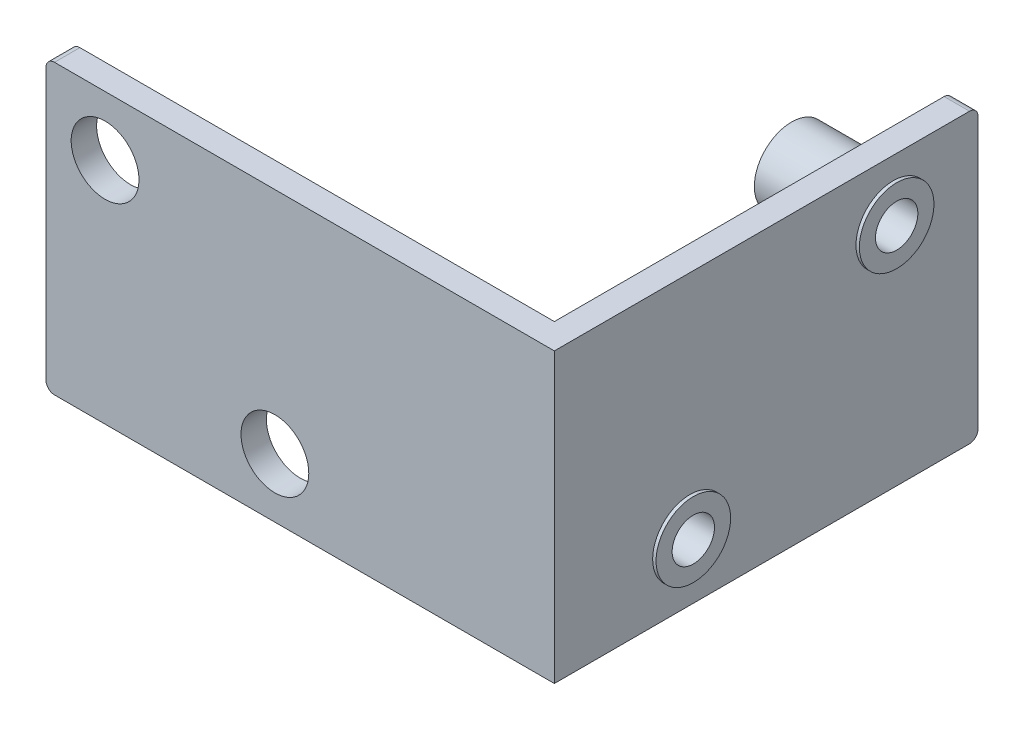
from build123d import *

# Parameters (mm, degrees)
ESQUISSE1_W             = 30
ESQUISSE1_H             = 17
EXTRUSION1_DEPTH        = 1.5
ESQUISSE2_R             = 2
ENL_V_MAT_EXTRU_1_DEPTH = 2
ESQUISSE3_W             = 1.5
ESQUISSE3_H             = 17
EXTRUSION2_DEPTH        = 23.5
ESQUISSE4_R             = 1.25
ENL_V_MAT_EXTRU_2_DEPTH = 2
EXTRUSION3_DEPTH        = 0.2
EXTRUSION3_DEPTH_BACK   = 6
ESQUISSE5_R             = 2.2
ESQUISSE5_R_2           = 1.25
CONG_1_R                = 0.5


with BuildPart() as part:
    # Esquisse1 → Extrusion1 (new body)
    with BuildSketch(Plane.XY):
        with Locations((6.051065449, -10.06674277)):
            Rectangle(ESQUISSE1_W, ESQUISSE1_H)
    extrude(amount=EXTRUSION1_DEPTH)

    # Esquisse2 → Enl_v. mat.-Extru.1 (cut)
    with BuildSketch(Plane.XY.offset(1.5)):
        with Locations((-5.463077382, -5.076163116)):
            Circle(ESQUISSE2_R)
        with Locations((4.558431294, -15.07006433)):
            Circle(ESQUISSE2_R)
    extrude(amount=-ENL_V_MAT_EXTRU_1_DEPTH, mode=Mode.SUBTRACT)

    # Esquisse3 → Extrusion2 (add)
    with BuildSketch(Plane(origin=(0, 0, 0), x_dir=(-1, 0, 0), z_dir=(0, 0, -1))):
        with Locations((-20.301065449, -10.06674277)):
            Rectangle(ESQUISSE3_W, ESQUISSE3_H)
    extrude(amount=EXTRUSION2_DEPTH)

    # Esquisse4 → Enl_v. mat.-Extru.2 (cut)
    with BuildSketch(Plane(origin=(21.051065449, 0, 0), x_dir=(0, 0, -1), z_dir=(1, 0, 0))):
        with Locations((6.5, -15.107440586)):
            Circle(ESQUISSE4_R)
        with Locations((18.5, -5.06674277)):
            Circle(ESQUISSE4_R)
    extrude(amount=-ENL_V_MAT_EXTRU_2_DEPTH, mode=Mode.SUBTRACT)

    # Esquisse5 → Extrusion3 (add, two sides: drawn at the far end of the back side and taken through both)
    # profile 1 of 2: a face of its own
    with BuildSketch(Plane(origin=(21.051065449, 0, 0), x_dir=(0, 0, -1), z_dir=(1, 0, 0)).offset(-EXTRUSION3_DEPTH_BACK)):
        with Locations(Location((6.5, -15.107440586, 0), (0, 0, 90))):
            Circle(ESQUISSE5_R)
        with Locations((6.5, -15.107440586)):
            Circle(ESQUISSE5_R_2, mode=Mode.SUBTRACT)
    # profile 2 of 2: a face of its own
    with BuildSketch(Plane(origin=(21.051065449, 0, 0), x_dir=(0, 0, -1), z_dir=(1, 0, 0)).offset(-EXTRUSION3_DEPTH_BACK)):
        with Locations(Location((18.5, -5.06674277, 0), (0, 0, 90))):
            Circle(ESQUISSE5_R)
        with Locations((18.5, -5.06674277)):
            Circle(ESQUISSE5_R_2, mode=Mode.SUBTRACT)
    extrude(amount=EXTRUSION3_DEPTH + EXTRUSION3_DEPTH_BACK)

    # Cong_1
    cong_1_edges = [part.edges().sort_by_distance(p)[0] for p in [
        (20.301065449, -18.56674277, -23.5),
        (20.301065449, -1.56674277, -23.5),
        (-8.948934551, -18.56674277, 0.75),
        (-8.948934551, -1.56674277, 0.75),
    ]]
    fillet(cong_1_edges, radius=CONG_1_R)


solid = part.part
